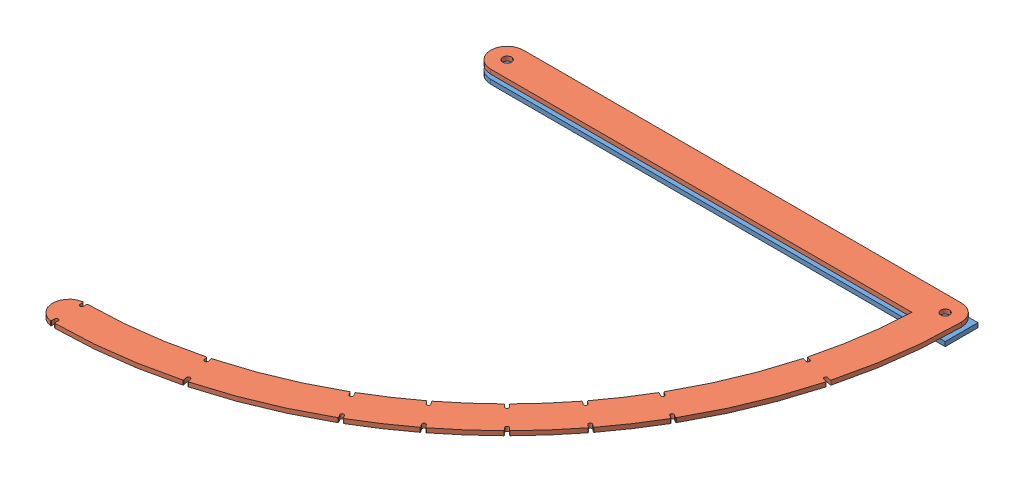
SolidWorks assembly Rotala Asse Goniometro.SLDASM, configuration Default (file format 7000). Lengths in mm.
Overall size (430 12 429.99).
2 component instances, 2 part files, 0 mates.
Components (placement in the parent):
- Rotaladef06-1: Rotaladef06.SLDPRT [Default] at (1828.5688 17.9551 -1775.2748) x (-1 0 0) z (0 0 -1) size (430 4 30)
- Rotaladef01-2: Rotaladef01.SLDPRT [Default] at (-2088.9424 25.9551 1910.3701) size (430 4 429.99)
